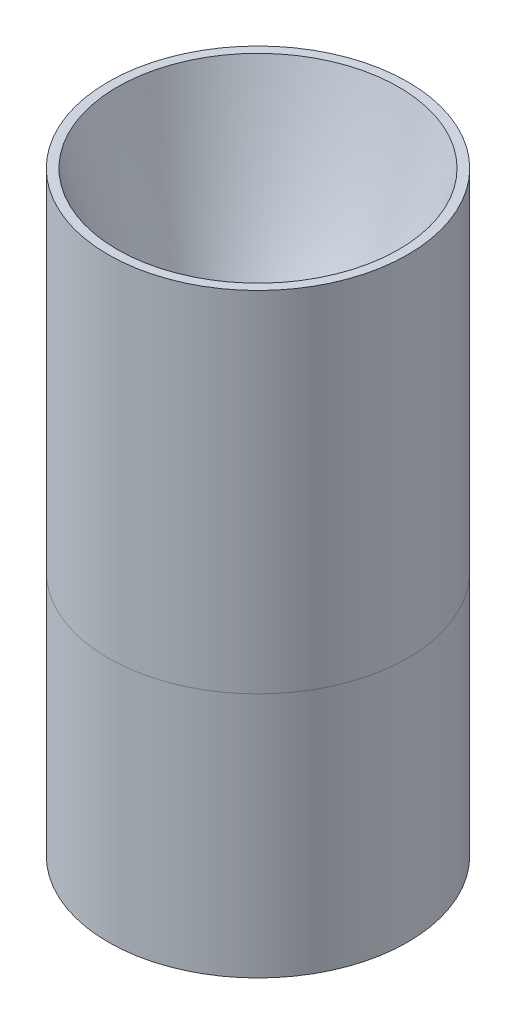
ISO-10303-21;
HEADER;
FILE_DESCRIPTION(('STEP AP214'),'2;1');
FILE_NAME('part.step','',(''),(''),'','','');
FILE_SCHEMA(('AUTOMOTIVE_DESIGN { 1 0 10303 214 1 1 1 1 }'));
ENDSEC;
DATA;
#1=APPLICATION_CONTEXT('core data for automotive mechanical design processes');
#2=APPLICATION_PROTOCOL_DEFINITION('international standard','automotive_design',2000,#1);
#3=PRODUCT_CONTEXT('',#1,'mechanical');
#4=PRODUCT('Part','Part','',(#3));
#5=PRODUCT_RELATED_PRODUCT_CATEGORY('part','',(#4));
#6=PRODUCT_DEFINITION_FORMATION('','',#4);
#7=PRODUCT_DEFINITION_CONTEXT('part definition',#1,'design');
#8=PRODUCT_DEFINITION('design','',#6,#7);
#9=PRODUCT_DEFINITION_SHAPE('','',#8);
#10=(LENGTH_UNIT() NAMED_UNIT(*) SI_UNIT(.MILLI.,.METRE.));
#11=(NAMED_UNIT(*) PLANE_ANGLE_UNIT() SI_UNIT($,.RADIAN.));
#12=(NAMED_UNIT(*) SI_UNIT($,.STERADIAN.) SOLID_ANGLE_UNIT());
#13=UNCERTAINTY_MEASURE_WITH_UNIT(LENGTH_MEASURE(1.E-05),#10,'distance_accuracy_value','');
#14=(GEOMETRIC_REPRESENTATION_CONTEXT(3) GLOBAL_UNCERTAINTY_ASSIGNED_CONTEXT((#13)) GLOBAL_UNIT_ASSIGNED_CONTEXT((#10,
#11,#12)) REPRESENTATION_CONTEXT('',''));
#15=CARTESIAN_POINT('',(0.,0.,0.));
#16=DIRECTION('',(0.,0.,1.));
#17=DIRECTION('',(1.,0.,0.));
#18=AXIS2_PLACEMENT_3D('',#15,#16,#17);
#19=CARTESIAN_POINT('',(-76.2,-67.8726529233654,-76.21));
#20=DIRECTION('',(0.,-1.,0.));
#21=DIRECTION('',(0.,0.,-1.));
#22=AXIS2_PLACEMENT_3D('',#19,#20,#21);
#23=PLANE('',#22);
#24=CARTESIAN_POINT('',(0.,-67.8726529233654,0.));
#25=DIRECTION('',(0.,-1.,0.));
#26=DIRECTION('',(0.,0.,-1.));
#27=AXIS2_PLACEMENT_3D('',#24,#25,#26);
#28=CIRCLE('',#27,53.7924602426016);
#29=CARTESIAN_POINT('',(0.,-67.8726529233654,-53.7924602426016));
#30=VERTEX_POINT('',#29);
#31=EDGE_CURVE('E98',#30,#30,#28,.F.);
#32=ORIENTED_EDGE('',*,*,#31,.T.);
#33=EDGE_LOOP('',(#32));
#34=FACE_BOUND('',#33,.T.);
#35=CARTESIAN_POINT('',(0.,-67.8726529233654,0.));
#36=DIRECTION('',(0.,-1.,0.));
#37=DIRECTION('',(0.,0.,-1.));
#38=AXIS2_PLACEMENT_3D('',#35,#36,#37);
#39=CIRCLE('',#38,76.2);
#40=CARTESIAN_POINT('',(0.,-67.8726529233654,-76.2));
#41=VERTEX_POINT('',#40);
#42=EDGE_CURVE('E46',#41,#41,#39,.T.);
#43=ORIENTED_EDGE('',*,*,#42,.T.);
#44=EDGE_LOOP('',(#43));
#45=FACE_BOUND('',#44,.T.);
#46=ADVANCED_FACE('F42',(#34,#45),#23,.T.);
#47=CARTESIAN_POINT('',(0.,0.,0.));
#48=DIRECTION('',(0.,1.,0.));
#49=DIRECTION('',(0.,0.,1.));
#50=AXIS2_PLACEMENT_3D('',#47,#48,#49);
#51=CYLINDRICAL_SURFACE('',#50,53.7924602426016);
#52=CARTESIAN_POINT('',(0.,-59.7276737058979,0.));
#53=DIRECTION('',(0.,1.,0.));
#54=DIRECTION('',(0.,0.,1.));
#55=AXIS2_PLACEMENT_3D('',#52,#53,#54);
#56=CIRCLE('',#55,53.7924602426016);
#57=CARTESIAN_POINT('',(0.,-59.7276737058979,53.7924602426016));
#58=VERTEX_POINT('',#57);
#59=EDGE_CURVE('E132',#58,#58,#56,.T.);
#60=ORIENTED_EDGE('',*,*,#59,.T.);
#61=EDGE_LOOP('',(#60));
#62=FACE_BOUND('',#61,.T.);
#63=ORIENTED_EDGE('',*,*,#31,.F.);
#64=EDGE_LOOP('',(#63));
#65=FACE_BOUND('',#64,.T.);
#66=ADVANCED_FACE('F44',(#62,#65),#51,.F.);
#67=CARTESIAN_POINT('',(0.,0.,0.));
#68=DIRECTION('',(0.,1.,0.));
#69=DIRECTION('',(0.,0.,1.));
#70=AXIS2_PLACEMENT_3D('',#67,#68,#69);
#71=CYLINDRICAL_SURFACE('',#70,76.2);
#72=CARTESIAN_POINT('',(0.,109.927347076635,0.));
#73=DIRECTION('',(0.,1.,0.));
#74=DIRECTION('',(0.,0.,1.));
#75=AXIS2_PLACEMENT_3D('',#72,#73,#74);
#76=CIRCLE('',#75,76.2);
#77=CARTESIAN_POINT('',(0.,109.927347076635,76.2));
#78=VERTEX_POINT('',#77);
#79=EDGE_CURVE('E55',#78,#78,#76,.T.);
#80=ORIENTED_EDGE('',*,*,#79,.F.);
#81=EDGE_LOOP('',(#80));
#82=FACE_BOUND('',#81,.T.);
#83=ORIENTED_EDGE('',*,*,#42,.F.);
#84=EDGE_LOOP('',(#83));
#85=FACE_BOUND('',#84,.T.);
#86=ADVANCED_FACE('F80',(#82,#85),#71,.T.);
#87=CARTESIAN_POINT('',(26.7062113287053,6.50923965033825,0.));
#88=CARTESIAN_POINT('',(26.6554523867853,6.45847884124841,0.));
#89=CARTESIAN_POINT('',(26.5813741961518,6.38212177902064,0.));
#90=CARTESIAN_POINT('',(26.4154873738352,6.20864164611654,0.));
#91=CARTESIAN_POINT('',(26.2772778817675,6.04995163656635,0.));
#92=CARTESIAN_POINT('',(26.089808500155,5.83291364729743,0.));
#93=CARTESIAN_POINT('',(25.9153376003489,5.61072754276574,0.));
#94=CARTESIAN_POINT('',(25.7027203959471,5.32551893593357,0.));
#95=CARTESIAN_POINT('',(25.5134468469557,5.04570386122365,0.));
#96=CARTESIAN_POINT('',(25.3274206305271,4.75130157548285,0.));
#97=CARTESIAN_POINT('',(25.1569443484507,4.45478312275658,0.));
#98=CARTESIAN_POINT('',(24.995002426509,4.14928218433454,0.));
#99=CARTESIAN_POINT('',(24.8462181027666,3.83966673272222,0.));
#100=CARTESIAN_POINT('',(24.7081288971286,3.52362715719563,0.));
#101=CARTESIAN_POINT('',(24.5825511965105,3.20334704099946,0.));
#102=CARTESIAN_POINT('',(24.4686735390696,2.87809264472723,0.));
#103=CARTESIAN_POINT('',(24.3672556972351,2.54923942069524,0.));
#104=CARTESIAN_POINT('',(24.2780737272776,2.21635441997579,0.));
#105=CARTESIAN_POINT('',(24.2014758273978,1.88099677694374,0.));
#106=CARTESIAN_POINT('',(24.1374314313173,1.54205049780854,0.));
#107=CARTESIAN_POINT('',(24.0861168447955,1.20253727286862,0.));
#108=CARTESIAN_POINT('',(24.0523672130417,0.901433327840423,0.));
#109=CARTESIAN_POINT('',(24.0314657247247,0.646764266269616,0.));
#110=CARTESIAN_POINT('',(24.0193936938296,0.427064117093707,0.));
#111=CARTESIAN_POINT('',(24.0129558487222,0.267641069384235,0.));
#112=CARTESIAN_POINT('',(24.0105384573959,0.11011368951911,0.));
#113=CARTESIAN_POINT('',(24.0100006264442,0.0358926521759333,0.));
#114=CARTESIAN_POINT('',(24.01,1.20494413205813E-13,0.));
#115=B_SPLINE_CURVE_WITH_KNOTS('',4,(#87,#88,#89,#90,#91,#92,#93,#94,#95,#96,#97,#98,#99,#100,
#101,#102,#103,#104,#105,#106,#107,#108,#109,#110,#111,#112,#113,#114),.UNSPECIFIED.,.F.,.F.,(5,
1,1,1,1,1,1,1,1,1,1,1,1,1,1,1,1,1,1,1,1,1,1,1,5),(0.0825688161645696,0.122284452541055,
0.142142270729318,0.162000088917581,0.201715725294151,0.241431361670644,0.281146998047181,
0.320862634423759,0.360578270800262,0.400293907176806,0.440009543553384,0.479725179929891,
0.519440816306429,0.55915645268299,0.598872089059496,0.638587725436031,0.678303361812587,
0.718018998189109,0.75773463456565,0.797450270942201,0.837165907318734,0.857023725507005,
0.876881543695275,0.896739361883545,0.916597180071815),.UNSPECIFIED.);
#116=CARTESIAN_POINT('',(0.,0.,0.));
#117=DIRECTION('',(0.,1.,0.));
#118=AXIS1_PLACEMENT('',#116,#117);
#119=SURFACE_OF_REVOLUTION('',#115,#118);
#120=CARTESIAN_POINT('',(0.,-4.72452789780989E-09,0.));
#121=DIRECTION('',(0.,1.,0.));
#122=DIRECTION('',(0.,0.,1.));
#123=AXIS2_PLACEMENT_3D('',#120,#121,#122);
#124=CIRCLE('',#123,24.0100000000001);
#125=CARTESIAN_POINT('',(0.,-4.72452789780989E-09,24.0100000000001));
#126=VERTEX_POINT('',#125);
#127=EDGE_CURVE('E100',#126,#126,#124,.T.);
#128=ORIENTED_EDGE('',*,*,#127,.F.);
#129=EDGE_LOOP('',(#128));
#130=FACE_BOUND('',#129,.T.);
#131=CARTESIAN_POINT('',(0.,6.50923965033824,0.));
#132=DIRECTION('',(0.,1.,0.));
#133=DIRECTION('',(0.,0.,1.));
#134=AXIS2_PLACEMENT_3D('',#131,#132,#133);
#135=CIRCLE('',#134,26.7062113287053);
#136=CARTESIAN_POINT('',(0.,6.50923965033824,26.7062113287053));
#137=VERTEX_POINT('',#136);
#138=EDGE_CURVE('E12',#137,#137,#135,.T.);
#139=ORIENTED_EDGE('',*,*,#138,.T.);
#140=EDGE_LOOP('',(#139));
#141=FACE_BOUND('',#140,.T.);
#142=ADVANCED_FACE('F82',(#130,#141),#119,.T.);
#143=CARTESIAN_POINT('',(24.0100000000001,-4.72452789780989E-09,0.));
#144=CARTESIAN_POINT('',(24.0100012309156,-0.0705286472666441,0.));
#145=CARTESIAN_POINT('',(24.0105303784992,-0.213584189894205,0.));
#146=CARTESIAN_POINT('',(24.0129060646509,-0.54318291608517,0.));
#147=CARTESIAN_POINT('',(24.0192304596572,-0.824160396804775,0.));
#148=CARTESIAN_POINT('',(24.0287155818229,-1.1948220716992,0.));
#149=CARTESIAN_POINT('',(24.0413578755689,-1.51343505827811,0.));
#150=CARTESIAN_POINT('',(24.0571581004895,-1.86193960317,0.));
#151=CARTESIAN_POINT('',(24.07611335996,-2.19370687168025,0.));
#152=CARTESIAN_POINT('',(24.1037509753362,-2.61806939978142,0.));
#153=CARTESIAN_POINT('',(24.143219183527,-3.12203394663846,0.));
#154=CARTESIAN_POINT('',(24.2142318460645,-3.87997867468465,0.));
#155=CARTESIAN_POINT('',(24.3340588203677,-4.88645038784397,0.));
#156=CARTESIAN_POINT('',(24.5104181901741,-6.05671075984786,0.));
#157=CARTESIAN_POINT('',(24.7618173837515,-7.38516641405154,0.));
#158=CARTESIAN_POINT('',(25.0627274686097,-8.70357451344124,0.));
#159=CARTESIAN_POINT('',(25.4127027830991,-10.0096372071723,0.));
#160=CARTESIAN_POINT('',(25.8112931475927,-11.3018195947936,0.));
#161=CARTESIAN_POINT('',(26.2578775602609,-12.578099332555,0.));
#162=CARTESIAN_POINT('',(26.7519354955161,-13.8368874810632,0.));
#163=CARTESIAN_POINT('',(27.2926052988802,-15.0761971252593,0.));
#164=CARTESIAN_POINT('',(27.8794115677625,-16.2946097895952,0.));
#165=CARTESIAN_POINT('',(28.5110715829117,-17.4899387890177,0.));
#166=CARTESIAN_POINT('',(29.187464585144,-18.6612877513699,0.));
#167=CARTESIAN_POINT('',(29.906377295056,-19.8057433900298,0.));
#168=CARTESIAN_POINT('',(30.6689541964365,-20.923860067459,0.));
#169=CARTESIAN_POINT('',(31.3700993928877,-21.8744117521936,0.));
#170=CARTESIAN_POINT('',(31.9996683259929,-22.6734454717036,0.));
#171=CARTESIAN_POINT('',(32.5350606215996,-23.32042212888,0.));
#172=CARTESIAN_POINT('',(32.9831879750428,-23.8400050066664,0.));
#173=CARTESIAN_POINT('',(33.419382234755,-24.329816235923,0.));
#174=CARTESIAN_POINT('',(33.8467583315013,-24.7884843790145,0.));
#175=CARTESIAN_POINT('',(34.1564908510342,-25.1138682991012,0.));
#176=CARTESIAN_POINT('',(34.4477921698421,-25.4096490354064,0.));
#177=CARTESIAN_POINT('',(34.5473446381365,-25.5099499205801,0.));
#178=CARTESIAN_POINT('',(34.5972150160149,-25.5598221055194,0.));
#179=B_SPLINE_CURVE_WITH_KNOTS('',4,(#143,#144,#145,#146,#147,#148,#149,#150,#151,#152,#153,
#154,#155,#156,#157,#158,#159,#160,#161,#162,#163,#164,#165,#166,#167,#168,#169,#170,#171,#172,
#173,#174,#175,#176,#177,#178),.UNSPECIFIED.,.F.,.F.,(5,1,1,1,1,1,1,1,1,1,1,1,1,1,1,1,1,1,1,1,1,
1,1,1,1,1,1,1,1,1,1,1,5),(0.0826377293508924,0.0925749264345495,0.10251212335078,
0.11244932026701,0.122386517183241,0.132323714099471,0.142260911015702,0.152198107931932,
0.162135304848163,0.182009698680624,0.201884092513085,0.241632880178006,0.281381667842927,
0.321130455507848,0.360879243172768,0.400628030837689,0.44037681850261,0.480125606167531,
0.519874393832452,0.559623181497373,0.599371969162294,0.639120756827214,0.678869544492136,
0.718618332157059,0.758367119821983,0.798115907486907,0.817990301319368,0.837864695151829,
0.857739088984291,0.877613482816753,0.897487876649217,0.907425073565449,0.917362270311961),.UNSPECIFIED.);
#180=CARTESIAN_POINT('',(0.,0.,0.));
#181=DIRECTION('',(0.,1.,0.));
#182=AXIS1_PLACEMENT('',#180,#181);
#183=SURFACE_OF_REVOLUTION('',#179,#182);
#184=CARTESIAN_POINT('',(0.,-25.5598221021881,0.));
#185=DIRECTION('',(0.,1.,0.));
#186=DIRECTION('',(0.,0.,1.));
#187=AXIS2_PLACEMENT_3D('',#184,#185,#186);
#188=CIRCLE('',#187,34.5972150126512);
#189=CARTESIAN_POINT('',(0.,-25.5598221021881,34.5972150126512));
#190=VERTEX_POINT('',#189);
#191=EDGE_CURVE('E103',#190,#190,#188,.T.);
#192=ORIENTED_EDGE('',*,*,#191,.F.);
#193=EDGE_LOOP('',(#192));
#194=FACE_BOUND('',#193,.T.);
#195=ORIENTED_EDGE('',*,*,#127,.T.);
#196=EDGE_LOOP('',(#195));
#197=FACE_BOUND('',#196,.T.);
#198=ADVANCED_FACE('F88',(#194,#197),#183,.T.);
#199=CARTESIAN_POINT('',(0.,-25.5598221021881,0.));
#200=DIRECTION('',(0.,-1.,0.));
#201=DIRECTION('',(0.,0.,-1.));
#202=AXIS2_PLACEMENT_3D('',#199,#200,#201);
#203=CONICAL_SURFACE('',#202,34.5972150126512,0.785398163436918);
#204=CARTESIAN_POINT('',(0.,-34.1674502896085,0.));
#205=DIRECTION('',(0.,1.,0.));
#206=DIRECTION('',(0.,0.,1.));
#207=AXIS2_PLACEMENT_3D('',#204,#205,#206);
#208=CIRCLE('',#207,43.2048432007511);
#209=CARTESIAN_POINT('',(0.,-34.1674502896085,43.2048432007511));
#210=VERTEX_POINT('',#209);
#211=EDGE_CURVE('E135',#210,#210,#208,.T.);
#212=ORIENTED_EDGE('',*,*,#211,.F.);
#213=EDGE_LOOP('',(#212));
#214=FACE_BOUND('',#213,.T.);
#215=ORIENTED_EDGE('',*,*,#191,.T.);
#216=EDGE_LOOP('',(#215));
#217=FACE_BOUND('',#216,.T.);
#218=ADVANCED_FACE('F118',(#214,#217),#203,.F.);
#219=CARTESIAN_POINT('',(43.2048432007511,-34.1674502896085,0.));
#220=CARTESIAN_POINT('',(43.254715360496,-34.2173226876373,0.));
#221=CARTESIAN_POINT('',(43.3553242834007,-34.3186769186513,0.));
#222=CARTESIAN_POINT('',(43.5850046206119,-34.5517100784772,0.));
#223=CARTESIAN_POINT('',(43.7848568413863,-34.7605007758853,0.));
#224=CARTESIAN_POINT('',(44.0923897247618,-35.0847918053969,0.));
#225=CARTESIAN_POINT('',(44.425708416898,-35.4471532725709,0.));
#226=CARTESIAN_POINT('',(44.8260591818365,-35.894408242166,0.));
#227=CARTESIAN_POINT('',(45.2637499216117,-36.4035418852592,0.));
#228=CARTESIAN_POINT('',(45.8044701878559,-37.0558327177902,0.));
#229=CARTESIAN_POINT('',(46.4308013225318,-37.8516123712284,0.));
#230=CARTESIAN_POINT('',(47.1340344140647,-38.8042368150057,0.));
#231=CARTESIAN_POINT('',(47.8954078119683,-39.9211332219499,0.));
#232=CARTESIAN_POINT('',(48.6150575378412,-41.0663154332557,0.));
#233=CARTESIAN_POINT('',(49.2910525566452,-42.2372537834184,0.));
#234=CARTESIAN_POINT('',(49.9229932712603,-43.4328620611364,0.));
#235=CARTESIAN_POINT('',(50.5096661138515,-44.6511293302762,0.));
#236=CARTESIAN_POINT('',(51.0504527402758,-45.8905689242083,0.));
#237=CARTESIAN_POINT('',(51.5444702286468,-47.1492955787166,0.));
#238=CARTESIAN_POINT('',(51.9352811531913,-48.2661297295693,0.));
#239=CARTESIAN_POINT('',(52.2402217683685,-49.2332382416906,0.));
#240=CARTESIAN_POINT('',(52.5209466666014,-50.2076495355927,0.));
#241=CARTESIAN_POINT('',(52.7773075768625,-51.1886995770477,0.));
#242=CARTESIAN_POINT('',(53.0029966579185,-52.1776033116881,0.));
#243=CARTESIAN_POINT('',(53.1977433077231,-53.1725857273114,0.));
#244=CARTESIAN_POINT('',(53.3676082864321,-54.1725959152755,0.));
#245=CARTESIAN_POINT('',(53.4883593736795,-55.0083263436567,0.));
#246=CARTESIAN_POINT('',(53.5882209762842,-55.8486408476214,0.));
#247=CARTESIAN_POINT('',(53.667125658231,-56.6881586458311,0.));
#248=CARTESIAN_POINT('',(53.7113378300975,-57.2811203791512,0.));
#249=CARTESIAN_POINT('',(53.7413501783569,-57.7817549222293,0.));
#250=CARTESIAN_POINT('',(53.7611010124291,-58.212998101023,0.));
#251=CARTESIAN_POINT('',(53.7737439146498,-58.532727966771,0.));
#252=CARTESIAN_POINT('',(53.7832294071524,-58.9049559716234,0.));
#253=CARTESIAN_POINT('',(53.7895540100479,-59.181725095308,0.));
#254=CARTESIAN_POINT('',(53.791929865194,-59.5155665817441,0.));
#255=CARTESIAN_POINT('',(53.7924590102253,-59.6571436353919,0.));
#256=CARTESIAN_POINT('',(53.7924602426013,-59.7276736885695,0.));
#257=B_SPLINE_CURVE_WITH_KNOTS('',4,(#219,#220,#221,#222,#223,#224,#225,#226,#227,#228,#229,
#230,#231,#232,#233,#234,#235,#236,#237,#238,#239,#240,#241,#242,#243,#244,#245,#246,#247,#248,
#249,#250,#251,#252,#253,#254,#255,#256),.UNSPECIFIED.,.F.,.F.,(5,1,1,1,1,1,1,1,1,1,1,1,1,1,1,1,
1,1,1,1,1,1,1,1,1,1,1,1,1,1,1,1,1,1,5),(0.0826377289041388,0.0925749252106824,0.102512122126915,
0.112449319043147,0.122386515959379,0.14226090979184,0.162135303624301,0.182009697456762,
0.201884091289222,0.241632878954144,0.281381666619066,0.321130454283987,0.360879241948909,
0.400628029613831,0.440376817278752,0.480125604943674,0.519874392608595,0.559623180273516,
0.599371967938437,0.619246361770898,0.639120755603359,0.678869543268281,0.718618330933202,
0.738492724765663,0.758367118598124,0.798115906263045,0.817990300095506,0.837864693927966,
0.857739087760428,0.867676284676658,0.877613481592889,0.887550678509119,0.897487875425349,
0.90742507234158,0.917362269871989),.UNSPECIFIED.);
#258=CARTESIAN_POINT('',(0.,0.,0.));
#259=DIRECTION('',(0.,1.,0.));
#260=AXIS1_PLACEMENT('',#258,#259);
#261=SURFACE_OF_REVOLUTION('',#257,#260);
#262=ORIENTED_EDGE('',*,*,#59,.F.);
#263=EDGE_LOOP('',(#262));
#264=FACE_BOUND('',#263,.T.);
#265=ORIENTED_EDGE('',*,*,#211,.T.);
#266=EDGE_LOOP('',(#265));
#267=FACE_BOUND('',#266,.T.);
#268=ADVANCED_FACE('F121',(#264,#267),#261,.T.);
#269=CARTESIAN_POINT('',(71.6384554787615,109.927347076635,0.));
#270=DIRECTION('',(0.,-1.,0.));
#271=DIRECTION('',(0.,0.,-1.));
#272=AXIS2_PLACEMENT_3D('',#269,#270,#271);
#273=PLANE('',#272);
#274=CARTESIAN_POINT('',(0.,109.927347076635,0.));
#275=DIRECTION('',(0.,1.,0.));
#276=DIRECTION('',(0.,0.,1.));
#277=AXIS2_PLACEMENT_3D('',#274,#275,#276);
#278=CIRCLE('',#277,71.6384554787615);
#279=CARTESIAN_POINT('',(0.,109.927347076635,71.6384554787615));
#280=VERTEX_POINT('',#279);
#281=EDGE_CURVE('E50',#280,#280,#278,.T.);
#282=ORIENTED_EDGE('',*,*,#281,.F.);
#283=EDGE_LOOP('',(#282));
#284=FACE_BOUND('',#283,.T.);
#285=ORIENTED_EDGE('',*,*,#79,.T.);
#286=EDGE_LOOP('',(#285));
#287=FACE_BOUND('',#286,.T.);
#288=ADVANCED_FACE('F75',(#284,#287),#273,.F.);
#289=CARTESIAN_POINT('',(71.6384554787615,109.927347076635,0.));
#290=CARTESIAN_POINT('',(49.1723334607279,34.6359542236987,0.));
#291=CARTESIAN_POINT('',(26.7062113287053,6.50923965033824,0.));
#292=B_SPLINE_CURVE_WITH_KNOTS('',2,(#289,#290,#291),.UNSPECIFIED.,.F.,.F.,(3,3),(0.,1.),.UNSPECIFIED.);
#293=CARTESIAN_POINT('',(0.,0.,0.));
#294=DIRECTION('',(0.,1.,0.));
#295=AXIS1_PLACEMENT('',#293,#294);
#296=SURFACE_OF_REVOLUTION('',#292,#295);
#297=ORIENTED_EDGE('',*,*,#138,.F.);
#298=EDGE_LOOP('',(#297));
#299=FACE_BOUND('',#298,.T.);
#300=ORIENTED_EDGE('',*,*,#281,.T.);
#301=EDGE_LOOP('',(#300));
#302=FACE_BOUND('',#301,.T.);
#303=ADVANCED_FACE('F71',(#299,#302),#296,.T.);
#304=CLOSED_SHELL('',(#46,#66,#86,#142,#198,#218,#268,#288,#303));
#305=MANIFOLD_SOLID_BREP('B2',#304);
#306=CARTESIAN_POINT('',(-76.2,-67.8726529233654,-76.21));
#307=DIRECTION('',(0.,-1.,0.));
#308=DIRECTION('',(0.,0.,-1.));
#309=AXIS2_PLACEMENT_3D('',#306,#307,#308);
#310=PLANE('',#309);
#311=CARTESIAN_POINT('',(0.,-67.8726529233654,0.));
#312=DIRECTION('',(0.,-1.,0.));
#313=DIRECTION('',(0.,0.,-1.));
#314=AXIS2_PLACEMENT_3D('',#311,#312,#313);
#315=CIRCLE('',#314,76.2);
#316=CARTESIAN_POINT('',(0.,-67.8726529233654,-76.2));
#317=VERTEX_POINT('',#316);
#318=EDGE_CURVE('E213',#317,#317,#315,.T.);
#319=ORIENTED_EDGE('',*,*,#318,.F.);
#320=EDGE_LOOP('',(#319));
#321=FACE_BOUND('',#320,.T.);
#322=CARTESIAN_POINT('',(0.,-67.8726529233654,0.));
#323=DIRECTION('',(0.,-1.,0.));
#324=DIRECTION('',(0.,0.,-1.));
#325=AXIS2_PLACEMENT_3D('',#322,#323,#324);
#326=CIRCLE('',#325,53.7924602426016);
#327=CARTESIAN_POINT('',(0.,-67.8726529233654,-53.7924602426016));
#328=VERTEX_POINT('',#327);
#329=EDGE_CURVE('E41',#328,#328,#326,.F.);
#330=ORIENTED_EDGE('',*,*,#329,.F.);
#331=EDGE_LOOP('',(#330));
#332=FACE_BOUND('',#331,.T.);
#333=ADVANCED_FACE('F207',(#321,#332),#310,.F.);
#334=CARTESIAN_POINT('',(76.2,-193.077673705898,0.));
#335=DIRECTION('',(0.,1.,0.));
#336=DIRECTION('',(0.,0.,1.));
#337=AXIS2_PLACEMENT_3D('',#334,#335,#336);
#338=PLANE('',#337);
#339=CARTESIAN_POINT('',(0.,-193.077673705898,0.));
#340=DIRECTION('',(0.,1.,0.));
#341=DIRECTION('',(0.,0.,1.));
#342=AXIS2_PLACEMENT_3D('',#339,#340,#341);
#343=CIRCLE('',#342,76.2);
#344=CARTESIAN_POINT('',(0.,-193.077673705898,76.2));
#345=VERTEX_POINT('',#344);
#346=EDGE_CURVE('E221',#345,#345,#343,.T.);
#347=ORIENTED_EDGE('',*,*,#346,.F.);
#348=EDGE_LOOP('',(#347));
#349=FACE_BOUND('',#348,.T.);
#350=CARTESIAN_POINT('',(0.,-193.077673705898,0.));
#351=DIRECTION('',(0.,1.,0.));
#352=DIRECTION('',(0.,0.,1.));
#353=AXIS2_PLACEMENT_3D('',#350,#351,#352);
#354=CIRCLE('',#353,53.7924602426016);
#355=CARTESIAN_POINT('',(0.,-193.077673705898,53.7924602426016));
#356=VERTEX_POINT('',#355);
#357=EDGE_CURVE('E217',#356,#356,#354,.T.);
#358=ORIENTED_EDGE('',*,*,#357,.T.);
#359=EDGE_LOOP('',(#358));
#360=FACE_BOUND('',#359,.T.);
#361=ADVANCED_FACE('F229',(#349,#360),#338,.F.);
#362=CARTESIAN_POINT('',(0.,0.,0.));
#363=DIRECTION('',(0.,1.,0.));
#364=DIRECTION('',(0.,0.,1.));
#365=AXIS2_PLACEMENT_3D('',#362,#363,#364);
#366=CYLINDRICAL_SURFACE('',#365,76.2);
#367=ORIENTED_EDGE('',*,*,#318,.T.);
#368=EDGE_LOOP('',(#367));
#369=FACE_BOUND('',#368,.T.);
#370=ORIENTED_EDGE('',*,*,#346,.T.);
#371=EDGE_LOOP('',(#370));
#372=FACE_BOUND('',#371,.T.);
#373=ADVANCED_FACE('F227',(#369,#372),#366,.T.);
#374=CARTESIAN_POINT('',(0.,0.,0.));
#375=DIRECTION('',(0.,1.,0.));
#376=DIRECTION('',(0.,0.,1.));
#377=AXIS2_PLACEMENT_3D('',#374,#375,#376);
#378=CYLINDRICAL_SURFACE('',#377,53.7924602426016);
#379=ORIENTED_EDGE('',*,*,#329,.T.);
#380=EDGE_LOOP('',(#379));
#381=FACE_BOUND('',#380,.T.);
#382=ORIENTED_EDGE('',*,*,#357,.F.);
#383=EDGE_LOOP('',(#382));
#384=FACE_BOUND('',#383,.T.);
#385=ADVANCED_FACE('F234',(#381,#384),#378,.F.);
#386=CLOSED_SHELL('',(#333,#361,#373,#385));
#387=MANIFOLD_SOLID_BREP('B7',#386);
#388=ADVANCED_BREP_SHAPE_REPRESENTATION('',(#18,#305,#387),#14);
#389=SHAPE_DEFINITION_REPRESENTATION(#9,#388);
ENDSEC;
END-ISO-10303-21;
